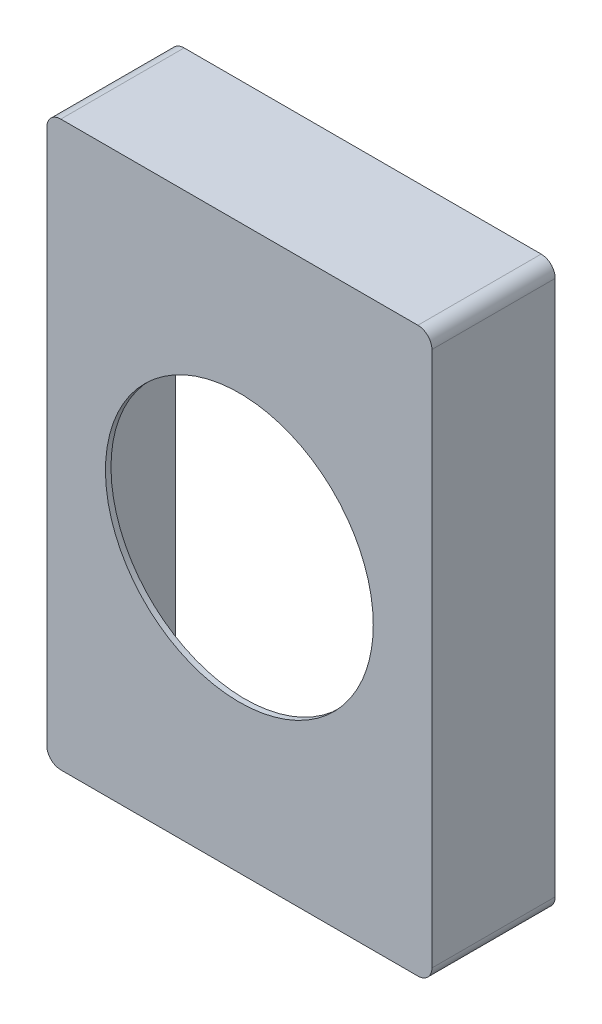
ISO-10303-21;
HEADER;
FILE_DESCRIPTION(('STEP AP214'),'2;1');
FILE_NAME('part.step','',(''),(''),'','','');
FILE_SCHEMA(('AUTOMOTIVE_DESIGN { 1 0 10303 214 1 1 1 1 }'));
ENDSEC;
DATA;
#1=APPLICATION_CONTEXT('core data for automotive mechanical design processes');
#2=APPLICATION_PROTOCOL_DEFINITION('international standard','automotive_design',2000,#1);
#3=PRODUCT_CONTEXT('',#1,'mechanical');
#4=PRODUCT('Part','Part','',(#3));
#5=PRODUCT_RELATED_PRODUCT_CATEGORY('part','',(#4));
#6=PRODUCT_DEFINITION_FORMATION('','',#4);
#7=PRODUCT_DEFINITION_CONTEXT('part definition',#1,'design');
#8=PRODUCT_DEFINITION('design','',#6,#7);
#9=PRODUCT_DEFINITION_SHAPE('','',#8);
#10=(LENGTH_UNIT() NAMED_UNIT(*) SI_UNIT(.MILLI.,.METRE.));
#11=(NAMED_UNIT(*) PLANE_ANGLE_UNIT() SI_UNIT($,.RADIAN.));
#12=(NAMED_UNIT(*) SI_UNIT($,.STERADIAN.) SOLID_ANGLE_UNIT());
#13=UNCERTAINTY_MEASURE_WITH_UNIT(LENGTH_MEASURE(1.E-05),#10,'distance_accuracy_value','');
#14=(GEOMETRIC_REPRESENTATION_CONTEXT(3) GLOBAL_UNCERTAINTY_ASSIGNED_CONTEXT((#13)) GLOBAL_UNIT_ASSIGNED_CONTEXT((#10,
#11,#12)) REPRESENTATION_CONTEXT('',''));
#15=CARTESIAN_POINT('',(0.,0.,0.));
#16=DIRECTION('',(0.,0.,1.));
#17=DIRECTION('',(1.,0.,0.));
#18=AXIS2_PLACEMENT_3D('',#15,#16,#17);
#19=CARTESIAN_POINT('',(32.,-8.49999999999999,-8.8));
#20=DIRECTION('',(0.,0.,1.));
#21=DIRECTION('',(1.,0.,0.));
#22=AXIS2_PLACEMENT_3D('',#19,#20,#21);
#23=CYLINDRICAL_SURFACE('',#22,5.);
#24=CARTESIAN_POINT('',(32.,-8.49999999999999,-8.8));
#25=DIRECTION('',(0.,0.,-1.));
#26=DIRECTION('',(-1.,0.,0.));
#27=AXIS2_PLACEMENT_3D('',#24,#25,#26);
#28=CIRCLE('',#27,5.);
#29=CARTESIAN_POINT('',(27.,-8.49999999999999,-8.8));
#30=VERTEX_POINT('',#29);
#31=EDGE_CURVE('E219',#30,#30,#28,.T.);
#32=ORIENTED_EDGE('',*,*,#31,.F.);
#33=EDGE_LOOP('',(#32));
#34=FACE_BOUND('',#33,.T.);
#35=DIRECTION('',(0.,0.,1.));
#36=VECTOR('',#35,1.);
#37=CARTESIAN_POINT('',(28.9350382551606,-12.4504442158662,-1.));
#38=LINE('',#37,#36);
#39=CARTESIAN_POINT('',(28.9350382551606,-12.4504442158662,-1.));
#40=VERTEX_POINT('',#39);
#41=CARTESIAN_POINT('',(28.9350382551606,-12.4504442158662,6.2));
#42=VERTEX_POINT('',#41);
#43=EDGE_CURVE('E175',#40,#42,#38,.T.);
#44=ORIENTED_EDGE('',*,*,#43,.F.);
#45=CARTESIAN_POINT('',(32.,-8.49999999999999,-1.));
#46=DIRECTION('',(0.,0.,1.));
#47=DIRECTION('',(1.,0.,0.));
#48=AXIS2_PLACEMENT_3D('',#45,#46,#47);
#49=CIRCLE('',#48,5.);
#50=CARTESIAN_POINT('',(31.2993973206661,-3.54932773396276,-1.));
#51=VERTEX_POINT('',#50);
#52=EDGE_CURVE('E179',#51,#40,#49,.T.);
#53=ORIENTED_EDGE('',*,*,#52,.F.);
#54=DIRECTION('',(0.,0.,1.));
#55=VECTOR('',#54,1.);
#56=CARTESIAN_POINT('',(31.2993973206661,-3.54932773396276,-1.));
#57=LINE('',#56,#55);
#58=CARTESIAN_POINT('',(31.2993973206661,-3.54932773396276,6.2));
#59=VERTEX_POINT('',#58);
#60=EDGE_CURVE('E177',#51,#59,#57,.T.);
#61=ORIENTED_EDGE('',*,*,#60,.T.);
#62=CARTESIAN_POINT('',(32.,-8.49999999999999,6.2));
#63=DIRECTION('',(0.,0.,-1.));
#64=DIRECTION('',(-1.,0.,0.));
#65=AXIS2_PLACEMENT_3D('',#62,#63,#64);
#66=CIRCLE('',#65,5.);
#67=EDGE_CURVE('E186',#59,#42,#66,.T.);
#68=ORIENTED_EDGE('',*,*,#67,.T.);
#69=EDGE_LOOP('',(#44,#53,#61,#68));
#70=FACE_BOUND('',#69,.T.);
#71=ADVANCED_FACE('F47',(#34,#70),#23,.T.);
#72=CARTESIAN_POINT('',(0.,0.,7.5));
#73=DIRECTION('',(0.,0.,1.));
#74=DIRECTION('',(1.,0.,0.));
#75=AXIS2_PLACEMENT_3D('',#72,#73,#74);
#76=PLANE('',#75);
#77=CARTESIAN_POINT('',(0.,0.,7.5));
#78=DIRECTION('',(0.,0.,1.));
#79=DIRECTION('',(1.,0.,0.));
#80=AXIS2_PLACEMENT_3D('',#77,#78,#79);
#81=CIRCLE('',#80,31.5);
#82=CARTESIAN_POINT('',(31.5,0.,7.5));
#83=VERTEX_POINT('',#82);
#84=EDGE_CURVE('E239',#83,#83,#81,.T.);
#85=ORIENTED_EDGE('',*,*,#84,.F.);
#86=EDGE_LOOP('',(#85));
#87=FACE_BOUND('',#86,.T.);
#88=DIRECTION('',(-1.,0.,0.));
#89=VECTOR('',#88,1.);
#90=CARTESIAN_POINT('',(-45.3,66.3,7.5));
#91=LINE('',#90,#89);
#92=CARTESIAN_POINT('',(42.,66.3,7.5));
#93=VERTEX_POINT('',#92);
#94=CARTESIAN_POINT('',(-42.,66.3,7.5));
#95=VERTEX_POINT('',#94);
#96=EDGE_CURVE('E254',#93,#95,#91,.T.);
#97=ORIENTED_EDGE('',*,*,#96,.T.);
#98=CARTESIAN_POINT('',(-42.,63.,7.5));
#99=DIRECTION('',(0.,0.,1.));
#100=DIRECTION('',(1.,0.,0.));
#101=AXIS2_PLACEMENT_3D('',#98,#99,#100);
#102=CIRCLE('',#101,3.3);
#103=CARTESIAN_POINT('',(-45.3,63.,7.5));
#104=VERTEX_POINT('',#103);
#105=EDGE_CURVE('E347',#95,#104,#102,.T.);
#106=ORIENTED_EDGE('',*,*,#105,.T.);
#107=DIRECTION('',(0.,-1.,0.));
#108=VECTOR('',#107,1.);
#109=CARTESIAN_POINT('',(-45.3,66.3,7.5));
#110=LINE('',#109,#108);
#111=CARTESIAN_POINT('',(-45.3,-63.,7.5));
#112=VERTEX_POINT('',#111);
#113=EDGE_CURVE('E270',#104,#112,#110,.T.);
#114=ORIENTED_EDGE('',*,*,#113,.T.);
#115=CARTESIAN_POINT('',(-42.,-63.,7.5));
#116=DIRECTION('',(0.,0.,1.));
#117=DIRECTION('',(1.,0.,0.));
#118=AXIS2_PLACEMENT_3D('',#115,#116,#117);
#119=CIRCLE('',#118,3.3);
#120=CARTESIAN_POINT('',(-42.,-66.3,7.5));
#121=VERTEX_POINT('',#120);
#122=EDGE_CURVE('E345',#112,#121,#119,.T.);
#123=ORIENTED_EDGE('',*,*,#122,.T.);
#124=DIRECTION('',(1.,0.,0.));
#125=VECTOR('',#124,1.);
#126=CARTESIAN_POINT('',(-45.3,-66.3,7.5));
#127=LINE('',#126,#125);
#128=CARTESIAN_POINT('',(42.,-66.3,7.5));
#129=VERTEX_POINT('',#128);
#130=EDGE_CURVE('E273',#121,#129,#127,.T.);
#131=ORIENTED_EDGE('',*,*,#130,.T.);
#132=CARTESIAN_POINT('',(42.,-63.,7.5));
#133=DIRECTION('',(0.,0.,1.));
#134=DIRECTION('',(1.,0.,0.));
#135=AXIS2_PLACEMENT_3D('',#132,#133,#134);
#136=CIRCLE('',#135,3.3);
#137=CARTESIAN_POINT('',(45.3,-63.,7.5));
#138=VERTEX_POINT('',#137);
#139=EDGE_CURVE('E343',#129,#138,#136,.T.);
#140=ORIENTED_EDGE('',*,*,#139,.T.);
#141=DIRECTION('',(0.,1.,0.));
#142=VECTOR('',#141,1.);
#143=CARTESIAN_POINT('',(45.3,66.3,7.5));
#144=LINE('',#143,#142);
#145=CARTESIAN_POINT('',(45.3,63.,7.5));
#146=VERTEX_POINT('',#145);
#147=EDGE_CURVE('E259',#138,#146,#144,.T.);
#148=ORIENTED_EDGE('',*,*,#147,.T.);
#149=CARTESIAN_POINT('',(42.,63.,7.5));
#150=DIRECTION('',(0.,0.,1.));
#151=DIRECTION('',(1.,0.,0.));
#152=AXIS2_PLACEMENT_3D('',#149,#150,#151);
#153=CIRCLE('',#152,3.3);
#154=EDGE_CURVE('E341',#146,#93,#153,.T.);
#155=ORIENTED_EDGE('',*,*,#154,.T.);
#156=EDGE_LOOP('',(#97,#106,#114,#123,#131,#140,#148,#155));
#157=FACE_BOUND('',#156,.T.);
#158=ADVANCED_FACE('F374',(#87,#157),#76,.T.);
#159=CARTESIAN_POINT('',(-44.,65.,-21.5));
#160=DIRECTION('',(-1.,0.,0.));
#161=DIRECTION('',(0.,0.,1.));
#162=AXIS2_PLACEMENT_3D('',#159,#160,#161);
#163=PLANE('',#162);
#164=DIRECTION('',(0.,-1.,0.));
#165=VECTOR('',#164,1.);
#166=CARTESIAN_POINT('',(-44.,65.,-21.5));
#167=LINE('',#166,#165);
#168=CARTESIAN_POINT('',(-44.,63.,-21.5));
#169=VERTEX_POINT('',#168);
#170=CARTESIAN_POINT('',(-44.,-63.,-21.5));
#171=VERTEX_POINT('',#170);
#172=EDGE_CURVE('E242',#169,#171,#167,.T.);
#173=ORIENTED_EDGE('',*,*,#172,.F.);
#174=DIRECTION('',(0.,0.,1.));
#175=VECTOR('',#174,1.);
#176=CARTESIAN_POINT('',(-44.,63.,6.2));
#177=LINE('',#176,#175);
#178=CARTESIAN_POINT('',(-44.,63.,6.2));
#179=VERTEX_POINT('',#178);
#180=EDGE_CURVE('E302',#169,#179,#177,.T.);
#181=ORIENTED_EDGE('',*,*,#180,.T.);
#182=DIRECTION('',(0.,-1.,0.));
#183=VECTOR('',#182,1.);
#184=CARTESIAN_POINT('',(-44.,0.,6.2));
#185=LINE('',#184,#183);
#186=CARTESIAN_POINT('',(-44.,-63.,6.2));
#187=VERTEX_POINT('',#186);
#188=EDGE_CURVE('E283',#179,#187,#185,.T.);
#189=ORIENTED_EDGE('',*,*,#188,.T.);
#190=DIRECTION('',(0.,0.,1.));
#191=VECTOR('',#190,1.);
#192=CARTESIAN_POINT('',(-44.,-63.,-21.5));
#193=LINE('',#192,#191);
#194=EDGE_CURVE('E196',#187,#171,#193,.F.);
#195=ORIENTED_EDGE('',*,*,#194,.T.);
#196=EDGE_LOOP('',(#173,#181,#189,#195));
#197=FACE_BOUND('',#196,.T.);
#198=ADVANCED_FACE('F413',(#197),#163,.F.);
#199=CARTESIAN_POINT('',(-44.,65.,-21.5));
#200=DIRECTION('',(0.,1.,0.));
#201=DIRECTION('',(0.,0.,1.));
#202=AXIS2_PLACEMENT_3D('',#199,#200,#201);
#203=PLANE('',#202);
#204=DIRECTION('',(1.,0.,0.));
#205=VECTOR('',#204,1.);
#206=CARTESIAN_POINT('',(0.,65.,6.2));
#207=LINE('',#206,#205);
#208=CARTESIAN_POINT('',(-42.,65.,6.2));
#209=VERTEX_POINT('',#208);
#210=CARTESIAN_POINT('',(42.,65.,6.2));
#211=VERTEX_POINT('',#210);
#212=EDGE_CURVE('E280',#209,#211,#207,.T.);
#213=ORIENTED_EDGE('',*,*,#212,.F.);
#214=DIRECTION('',(0.,0.,1.));
#215=VECTOR('',#214,1.);
#216=CARTESIAN_POINT('',(-42.,65.,-21.5));
#217=LINE('',#216,#215);
#218=CARTESIAN_POINT('',(-42.,65.,-21.5));
#219=VERTEX_POINT('',#218);
#220=EDGE_CURVE('E316',#209,#219,#217,.F.);
#221=ORIENTED_EDGE('',*,*,#220,.T.);
#222=DIRECTION('',(-1.,0.,0.));
#223=VECTOR('',#222,1.);
#224=CARTESIAN_POINT('',(-44.,65.,-21.5));
#225=LINE('',#224,#223);
#226=CARTESIAN_POINT('',(42.,65.,-21.5));
#227=VERTEX_POINT('',#226);
#228=EDGE_CURVE('E251',#227,#219,#225,.T.);
#229=ORIENTED_EDGE('',*,*,#228,.F.);
#230=DIRECTION('',(0.,0.,1.));
#231=VECTOR('',#230,1.);
#232=CARTESIAN_POINT('',(42.,65.,6.2));
#233=LINE('',#232,#231);
#234=EDGE_CURVE('E313',#227,#211,#233,.T.);
#235=ORIENTED_EDGE('',*,*,#234,.T.);
#236=EDGE_LOOP('',(#213,#221,#229,#235));
#237=FACE_BOUND('',#236,.T.);
#238=ADVANCED_FACE('F460',(#237),#203,.F.);
#239=CARTESIAN_POINT('',(44.,65.,-21.5));
#240=DIRECTION('',(1.,0.,0.));
#241=DIRECTION('',(0.,0.,-1.));
#242=AXIS2_PLACEMENT_3D('',#239,#240,#241);
#243=PLANE('',#242);
#244=DIRECTION('',(0.,1.,0.));
#245=VECTOR('',#244,1.);
#246=CARTESIAN_POINT('',(44.,65.,-21.5));
#247=LINE('',#246,#245);
#248=CARTESIAN_POINT('',(44.,-63.,-21.5));
#249=VERTEX_POINT('',#248);
#250=CARTESIAN_POINT('',(44.,63.,-21.5));
#251=VERTEX_POINT('',#250);
#252=EDGE_CURVE('E248',#249,#251,#247,.T.);
#253=ORIENTED_EDGE('',*,*,#252,.F.);
#254=DIRECTION('',(0.,0.,1.));
#255=VECTOR('',#254,1.);
#256=CARTESIAN_POINT('',(44.,-63.,6.19999999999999));
#257=LINE('',#256,#255);
#258=CARTESIAN_POINT('',(44.,-63.,6.2));
#259=VERTEX_POINT('',#258);
#260=EDGE_CURVE('E325',#249,#259,#257,.T.);
#261=ORIENTED_EDGE('',*,*,#260,.T.);
#262=DIRECTION('',(0.,-1.,0.));
#263=VECTOR('',#262,1.);
#264=CARTESIAN_POINT('',(44.,0.,6.2));
#265=LINE('',#264,#263);
#266=CARTESIAN_POINT('',(44.,63.,6.2));
#267=VERTEX_POINT('',#266);
#268=EDGE_CURVE('E267',#267,#259,#265,.T.);
#269=ORIENTED_EDGE('',*,*,#268,.F.);
#270=DIRECTION('',(0.,0.,1.));
#271=VECTOR('',#270,1.);
#272=CARTESIAN_POINT('',(44.,63.,-21.5));
#273=LINE('',#272,#271);
#274=EDGE_CURVE('E323',#267,#251,#273,.F.);
#275=ORIENTED_EDGE('',*,*,#274,.T.);
#276=EDGE_LOOP('',(#253,#261,#269,#275));
#277=FACE_BOUND('',#276,.T.);
#278=ADVANCED_FACE('F463',(#277),#243,.F.);
#279=CARTESIAN_POINT('',(-44.,-65.,-21.5));
#280=DIRECTION('',(0.,-1.,0.));
#281=DIRECTION('',(0.,0.,-1.));
#282=AXIS2_PLACEMENT_3D('',#279,#280,#281);
#283=PLANE('',#282);
#284=DIRECTION('',(1.,0.,0.));
#285=VECTOR('',#284,1.);
#286=CARTESIAN_POINT('',(-44.,-65.,-21.5));
#287=LINE('',#286,#285);
#288=CARTESIAN_POINT('',(-42.,-65.,-21.5));
#289=VERTEX_POINT('',#288);
#290=CARTESIAN_POINT('',(42.,-65.,-21.5));
#291=VERTEX_POINT('',#290);
#292=EDGE_CURVE('E245',#289,#291,#287,.T.);
#293=ORIENTED_EDGE('',*,*,#292,.F.);
#294=DIRECTION('',(0.,0.,1.));
#295=VECTOR('',#294,1.);
#296=CARTESIAN_POINT('',(-42.,-65.,6.2));
#297=LINE('',#296,#295);
#298=CARTESIAN_POINT('',(-42.,-65.,6.2));
#299=VERTEX_POINT('',#298);
#300=EDGE_CURVE('E320',#289,#299,#297,.T.);
#301=ORIENTED_EDGE('',*,*,#300,.T.);
#302=DIRECTION('',(1.,0.,0.));
#303=VECTOR('',#302,1.);
#304=CARTESIAN_POINT('',(0.,-65.,6.2));
#305=LINE('',#304,#303);
#306=CARTESIAN_POINT('',(42.,-65.,6.2));
#307=VERTEX_POINT('',#306);
#308=EDGE_CURVE('E286',#299,#307,#305,.T.);
#309=ORIENTED_EDGE('',*,*,#308,.T.);
#310=DIRECTION('',(0.,0.,1.));
#311=VECTOR('',#310,1.);
#312=CARTESIAN_POINT('',(42.,-65.,-21.5));
#313=LINE('',#312,#311);
#314=EDGE_CURVE('E318',#307,#291,#313,.F.);
#315=ORIENTED_EDGE('',*,*,#314,.T.);
#316=EDGE_LOOP('',(#293,#301,#309,#315));
#317=FACE_BOUND('',#316,.T.);
#318=ADVANCED_FACE('F467',(#317),#283,.F.);
#319=CARTESIAN_POINT('',(-45.3,66.3,-21.5));
#320=DIRECTION('',(0.,1.,0.));
#321=DIRECTION('',(0.,0.,1.));
#322=AXIS2_PLACEMENT_3D('',#319,#320,#321);
#323=PLANE('',#322);
#324=DIRECTION('',(-1.,0.,0.));
#325=VECTOR('',#324,1.);
#326=CARTESIAN_POINT('',(-45.3,66.3,-21.5));
#327=LINE('',#326,#325);
#328=CARTESIAN_POINT('',(42.,66.3,-21.5));
#329=VERTEX_POINT('',#328);
#330=CARTESIAN_POINT('',(-42.,66.3,-21.5));
#331=VERTEX_POINT('',#330);
#332=EDGE_CURVE('E255',#329,#331,#327,.T.);
#333=ORIENTED_EDGE('',*,*,#332,.T.);
#334=DIRECTION('',(0.,0.,1.));
#335=VECTOR('',#334,1.);
#336=CARTESIAN_POINT('',(-42.,66.3,-21.5));
#337=LINE('',#336,#335);
#338=EDGE_CURVE('E338',#331,#95,#337,.T.);
#339=ORIENTED_EDGE('',*,*,#338,.T.);
#340=ORIENTED_EDGE('',*,*,#96,.F.);
#341=DIRECTION('',(0.,0.,1.));
#342=VECTOR('',#341,1.);
#343=CARTESIAN_POINT('',(42.,66.3,-21.5));
#344=LINE('',#343,#342);
#345=EDGE_CURVE('E336',#93,#329,#344,.F.);
#346=ORIENTED_EDGE('',*,*,#345,.T.);
#347=EDGE_LOOP('',(#333,#339,#340,#346));
#348=FACE_BOUND('',#347,.T.);
#349=ADVANCED_FACE('F398',(#348),#323,.T.);
#350=CARTESIAN_POINT('',(45.3,66.3,-21.5));
#351=DIRECTION('',(1.,0.,0.));
#352=DIRECTION('',(0.,1.,0.));
#353=AXIS2_PLACEMENT_3D('',#350,#351,#352);
#354=PLANE('',#353);
#355=ORIENTED_EDGE('',*,*,#147,.F.);
#356=DIRECTION('',(0.,0.,1.));
#357=VECTOR('',#356,1.);
#358=CARTESIAN_POINT('',(45.3,-63.,-21.5));
#359=LINE('',#358,#357);
#360=CARTESIAN_POINT('',(45.3,-63.,-21.5));
#361=VERTEX_POINT('',#360);
#362=EDGE_CURVE('E11',#138,#361,#359,.F.);
#363=ORIENTED_EDGE('',*,*,#362,.T.);
#364=DIRECTION('',(0.,1.,0.));
#365=VECTOR('',#364,1.);
#366=CARTESIAN_POINT('',(45.3,66.3,-21.5));
#367=LINE('',#366,#365);
#368=CARTESIAN_POINT('',(45.3,63.,-21.5));
#369=VERTEX_POINT('',#368);
#370=EDGE_CURVE('E264',#361,#369,#367,.T.);
#371=ORIENTED_EDGE('',*,*,#370,.T.);
#372=DIRECTION('',(0.,0.,1.));
#373=VECTOR('',#372,1.);
#374=CARTESIAN_POINT('',(45.3,63.,-21.5));
#375=LINE('',#374,#373);
#376=EDGE_CURVE('E55',#369,#146,#375,.T.);
#377=ORIENTED_EDGE('',*,*,#376,.T.);
#378=EDGE_LOOP('',(#355,#363,#371,#377));
#379=FACE_BOUND('',#378,.T.);
#380=ADVANCED_FACE('F369',(#379),#354,.T.);
#381=CARTESIAN_POINT('',(-45.3,-66.3,-21.5));
#382=DIRECTION('',(0.,-1.,0.));
#383=DIRECTION('',(0.,0.,-1.));
#384=AXIS2_PLACEMENT_3D('',#381,#382,#383);
#385=PLANE('',#384);
#386=ORIENTED_EDGE('',*,*,#130,.F.);
#387=DIRECTION('',(0.,0.,1.));
#388=VECTOR('',#387,1.);
#389=CARTESIAN_POINT('',(-42.,-66.3,-21.5));
#390=LINE('',#389,#388);
#391=CARTESIAN_POINT('',(-42.,-66.3,-21.5));
#392=VERTEX_POINT('',#391);
#393=EDGE_CURVE('E364',#121,#392,#390,.F.);
#394=ORIENTED_EDGE('',*,*,#393,.T.);
#395=DIRECTION('',(1.,0.,0.));
#396=VECTOR('',#395,1.);
#397=CARTESIAN_POINT('',(-45.3,-66.3,-21.5));
#398=LINE('',#397,#396);
#399=CARTESIAN_POINT('',(42.,-66.3,-21.5));
#400=VERTEX_POINT('',#399);
#401=EDGE_CURVE('E262',#392,#400,#398,.T.);
#402=ORIENTED_EDGE('',*,*,#401,.T.);
#403=DIRECTION('',(0.,0.,1.));
#404=VECTOR('',#403,1.);
#405=CARTESIAN_POINT('',(42.,-66.3,-21.5));
#406=LINE('',#405,#404);
#407=EDGE_CURVE('E361',#400,#129,#406,.T.);
#408=ORIENTED_EDGE('',*,*,#407,.T.);
#409=EDGE_LOOP('',(#386,#394,#402,#408));
#410=FACE_BOUND('',#409,.T.);
#411=ADVANCED_FACE('F381',(#410),#385,.T.);
#412=CARTESIAN_POINT('',(-45.3,66.3,-21.5));
#413=DIRECTION('',(-1.,0.,0.));
#414=DIRECTION('',(0.,0.,1.));
#415=AXIS2_PLACEMENT_3D('',#412,#413,#414);
#416=PLANE('',#415);
#417=ORIENTED_EDGE('',*,*,#113,.F.);
#418=DIRECTION('',(0.,0.,1.));
#419=VECTOR('',#418,1.);
#420=CARTESIAN_POINT('',(-45.3,63.,-21.5));
#421=LINE('',#420,#419);
#422=CARTESIAN_POINT('',(-45.3,63.,-21.5));
#423=VERTEX_POINT('',#422);
#424=EDGE_CURVE('E352',#104,#423,#421,.F.);
#425=ORIENTED_EDGE('',*,*,#424,.T.);
#426=DIRECTION('',(0.,-1.,0.));
#427=VECTOR('',#426,1.);
#428=CARTESIAN_POINT('',(-45.3,66.3,-21.5));
#429=LINE('',#428,#427);
#430=CARTESIAN_POINT('',(-45.3,-63.,-21.5));
#431=VERTEX_POINT('',#430);
#432=EDGE_CURVE('E258',#423,#431,#429,.T.);
#433=ORIENTED_EDGE('',*,*,#432,.T.);
#434=DIRECTION('',(0.,0.,1.));
#435=VECTOR('',#434,1.);
#436=CARTESIAN_POINT('',(-45.3,-63.,-21.5));
#437=LINE('',#436,#435);
#438=EDGE_CURVE('E349',#431,#112,#437,.T.);
#439=ORIENTED_EDGE('',*,*,#438,.T.);
#440=EDGE_LOOP('',(#417,#425,#433,#439));
#441=FACE_BOUND('',#440,.T.);
#442=ADVANCED_FACE('F391',(#441),#416,.T.);
#443=CARTESIAN_POINT('',(0.,0.,-21.5));
#444=DIRECTION('',(0.,0.,-1.));
#445=DIRECTION('',(-1.,0.,0.));
#446=AXIS2_PLACEMENT_3D('',#443,#444,#445);
#447=PLANE('',#446);
#448=ORIENTED_EDGE('',*,*,#228,.T.);
#449=CARTESIAN_POINT('',(-42.,63.,-21.5));
#450=DIRECTION('',(0.,0.,-1.));
#451=DIRECTION('',(-1.,0.,0.));
#452=AXIS2_PLACEMENT_3D('',#449,#450,#451);
#453=CIRCLE('',#452,2.);
#454=EDGE_CURVE('E328',#219,#169,#453,.F.);
#455=ORIENTED_EDGE('',*,*,#454,.T.);
#456=ORIENTED_EDGE('',*,*,#172,.T.);
#457=CARTESIAN_POINT('',(-42.,-63.,-21.5));
#458=DIRECTION('',(0.,0.,-1.));
#459=DIRECTION('',(-1.,0.,0.));
#460=AXIS2_PLACEMENT_3D('',#457,#458,#459);
#461=CIRCLE('',#460,2.);
#462=EDGE_CURVE('E330',#171,#289,#461,.F.);
#463=ORIENTED_EDGE('',*,*,#462,.T.);
#464=ORIENTED_EDGE('',*,*,#292,.T.);
#465=CARTESIAN_POINT('',(42.,-63.,-21.5));
#466=DIRECTION('',(0.,0.,-1.));
#467=DIRECTION('',(-1.,0.,0.));
#468=AXIS2_PLACEMENT_3D('',#465,#466,#467);
#469=CIRCLE('',#468,2.);
#470=EDGE_CURVE('E332',#291,#249,#469,.F.);
#471=ORIENTED_EDGE('',*,*,#470,.T.);
#472=ORIENTED_EDGE('',*,*,#252,.T.);
#473=CARTESIAN_POINT('',(42.,63.,-21.5));
#474=DIRECTION('',(0.,0.,-1.));
#475=DIRECTION('',(-1.,0.,0.));
#476=AXIS2_PLACEMENT_3D('',#473,#474,#475);
#477=CIRCLE('',#476,2.);
#478=EDGE_CURVE('E334',#251,#227,#477,.F.);
#479=ORIENTED_EDGE('',*,*,#478,.T.);
#480=EDGE_LOOP('',(#448,#455,#456,#463,#464,#471,#472,#479));
#481=FACE_BOUND('',#480,.T.);
#482=ORIENTED_EDGE('',*,*,#432,.F.);
#483=CARTESIAN_POINT('',(-42.,63.,-21.5));
#484=DIRECTION('',(0.,0.,-1.));
#485=DIRECTION('',(-1.,0.,0.));
#486=AXIS2_PLACEMENT_3D('',#483,#484,#485);
#487=CIRCLE('',#486,3.3);
#488=EDGE_CURVE('E359',#423,#331,#487,.T.);
#489=ORIENTED_EDGE('',*,*,#488,.T.);
#490=ORIENTED_EDGE('',*,*,#332,.F.);
#491=CARTESIAN_POINT('',(42.,63.,-21.5));
#492=DIRECTION('',(0.,0.,-1.));
#493=DIRECTION('',(-1.,0.,0.));
#494=AXIS2_PLACEMENT_3D('',#491,#492,#493);
#495=CIRCLE('',#494,3.3);
#496=EDGE_CURVE('E354',#329,#369,#495,.T.);
#497=ORIENTED_EDGE('',*,*,#496,.T.);
#498=ORIENTED_EDGE('',*,*,#370,.F.);
#499=CARTESIAN_POINT('',(42.,-63.,-21.5));
#500=DIRECTION('',(0.,0.,-1.));
#501=DIRECTION('',(-1.,0.,0.));
#502=AXIS2_PLACEMENT_3D('',#499,#500,#501);
#503=CIRCLE('',#502,3.3);
#504=EDGE_CURVE('E69',#361,#400,#503,.T.);
#505=ORIENTED_EDGE('',*,*,#504,.T.);
#506=ORIENTED_EDGE('',*,*,#401,.F.);
#507=CARTESIAN_POINT('',(-42.,-63.,-21.5));
#508=DIRECTION('',(0.,0.,-1.));
#509=DIRECTION('',(-1.,0.,0.));
#510=AXIS2_PLACEMENT_3D('',#507,#508,#509);
#511=CIRCLE('',#510,3.3);
#512=EDGE_CURVE('E357',#392,#431,#511,.T.);
#513=ORIENTED_EDGE('',*,*,#512,.T.);
#514=EDGE_LOOP('',(#482,#489,#490,#497,#498,#505,#506,#513));
#515=FACE_BOUND('',#514,.T.);
#516=ADVANCED_FACE('F385',(#481,#515),#447,.T.);
#517=CARTESIAN_POINT('',(0.,0.,6.2));
#518=DIRECTION('',(0.,0.,1.));
#519=DIRECTION('',(1.,0.,0.));
#520=AXIS2_PLACEMENT_3D('',#517,#518,#519);
#521=PLANE('',#520);
#522=ORIENTED_EDGE('',*,*,#67,.F.);
#523=CARTESIAN_POINT('',(0.,0.,6.2));
#524=DIRECTION('',(0.,0.,1.));
#525=DIRECTION('',(1.,0.,0.));
#526=AXIS2_PLACEMENT_3D('',#523,#524,#525);
#527=CIRCLE('',#526,31.5);
#528=EDGE_CURVE('E238',#59,#42,#527,.T.);
#529=ORIENTED_EDGE('',*,*,#528,.T.);
#530=EDGE_LOOP('',(#522,#529));
#531=FACE_BOUND('',#530,.T.);
#532=CARTESIAN_POINT('',(31.,52.,6.2));
#533=DIRECTION('',(0.,0.,1.));
#534=DIRECTION('',(1.,0.,0.));
#535=AXIS2_PLACEMENT_3D('',#532,#533,#534);
#536=CIRCLE('',#535,5.);
#537=CARTESIAN_POINT('',(36.,52.,6.2));
#538=VERTEX_POINT('',#537);
#539=EDGE_CURVE('E222',#538,#538,#536,.F.);
#540=ORIENTED_EDGE('',*,*,#539,.F.);
#541=EDGE_LOOP('',(#540));
#542=FACE_BOUND('',#541,.T.);
#543=CARTESIAN_POINT('',(-33.5,55.,6.2));
#544=DIRECTION('',(0.,0.,1.));
#545=DIRECTION('',(1.,0.,0.));
#546=AXIS2_PLACEMENT_3D('',#543,#544,#545);
#547=CIRCLE('',#546,5.);
#548=CARTESIAN_POINT('',(-28.5,55.,6.2));
#549=VERTEX_POINT('',#548);
#550=EDGE_CURVE('E296',#549,#549,#547,.F.);
#551=ORIENTED_EDGE('',*,*,#550,.F.);
#552=EDGE_LOOP('',(#551));
#553=FACE_BOUND('',#552,.T.);
#554=CARTESIAN_POINT('',(-33.,-51.,6.2));
#555=DIRECTION('',(0.,0.,1.));
#556=DIRECTION('',(1.,0.,0.));
#557=AXIS2_PLACEMENT_3D('',#554,#555,#556);
#558=CIRCLE('',#557,5.);
#559=CARTESIAN_POINT('',(-28.,-51.,6.2));
#560=VERTEX_POINT('',#559);
#561=EDGE_CURVE('E293',#560,#560,#558,.F.);
#562=ORIENTED_EDGE('',*,*,#561,.F.);
#563=EDGE_LOOP('',(#562));
#564=FACE_BOUND('',#563,.T.);
#565=CARTESIAN_POINT('',(33.,-54.5,6.2));
#566=DIRECTION('',(0.,0.,1.));
#567=DIRECTION('',(1.,0.,0.));
#568=AXIS2_PLACEMENT_3D('',#565,#566,#567);
#569=CIRCLE('',#568,5.);
#570=CARTESIAN_POINT('',(38.,-54.5,6.2));
#571=VERTEX_POINT('',#570);
#572=EDGE_CURVE('E289',#571,#571,#569,.F.);
#573=ORIENTED_EDGE('',*,*,#572,.F.);
#574=EDGE_LOOP('',(#573));
#575=FACE_BOUND('',#574,.T.);
#576=ORIENTED_EDGE('',*,*,#188,.F.);
#577=CARTESIAN_POINT('',(-42.,63.,6.2));
#578=DIRECTION('',(0.,0.,1.));
#579=DIRECTION('',(1.,0.,0.));
#580=AXIS2_PLACEMENT_3D('',#577,#578,#579);
#581=CIRCLE('',#580,2.);
#582=EDGE_CURVE('E311',#179,#209,#581,.F.);
#583=ORIENTED_EDGE('',*,*,#582,.T.);
#584=ORIENTED_EDGE('',*,*,#212,.T.);
#585=CARTESIAN_POINT('',(42.,63.,6.2));
#586=DIRECTION('',(0.,0.,1.));
#587=DIRECTION('',(1.,0.,0.));
#588=AXIS2_PLACEMENT_3D('',#585,#586,#587);
#589=CIRCLE('',#588,2.);
#590=EDGE_CURVE('E305',#211,#267,#589,.F.);
#591=ORIENTED_EDGE('',*,*,#590,.T.);
#592=ORIENTED_EDGE('',*,*,#268,.T.);
#593=CARTESIAN_POINT('',(42.,-63.,6.2));
#594=DIRECTION('',(0.,0.,1.));
#595=DIRECTION('',(1.,0.,0.));
#596=AXIS2_PLACEMENT_3D('',#593,#594,#595);
#597=CIRCLE('',#596,2.);
#598=EDGE_CURVE('E307',#259,#307,#597,.F.);
#599=ORIENTED_EDGE('',*,*,#598,.T.);
#600=ORIENTED_EDGE('',*,*,#308,.F.);
#601=CARTESIAN_POINT('',(-42.,-63.,6.2));
#602=DIRECTION('',(0.,0.,1.));
#603=DIRECTION('',(1.,0.,0.));
#604=AXIS2_PLACEMENT_3D('',#601,#602,#603);
#605=CIRCLE('',#604,2.);
#606=EDGE_CURVE('E309',#299,#187,#605,.F.);
#607=ORIENTED_EDGE('',*,*,#606,.T.);
#608=EDGE_LOOP('',(#576,#583,#584,#591,#592,#599,#600,#607));
#609=FACE_BOUND('',#608,.T.);
#610=ADVANCED_FACE('F459',(#531,#542,#553,#564,#575,#609),#521,.F.);
#611=CARTESIAN_POINT('',(0.,0.,8.5));
#612=DIRECTION('',(0.,0.,-1.));
#613=DIRECTION('',(-1.,0.,0.));
#614=AXIS2_PLACEMENT_3D('',#611,#612,#613);
#615=CYLINDRICAL_SURFACE('',#614,31.5);
#616=ORIENTED_EDGE('',*,*,#43,.T.);
#617=ORIENTED_EDGE('',*,*,#528,.F.);
#618=ORIENTED_EDGE('',*,*,#60,.F.);
#619=CARTESIAN_POINT('',(0.,0.,-1.));
#620=DIRECTION('',(0.,0.,1.));
#621=DIRECTION('',(1.,0.,0.));
#622=AXIS2_PLACEMENT_3D('',#619,#620,#621);
#623=CIRCLE('',#622,31.5);
#624=EDGE_CURVE('E61',#51,#40,#623,.F.);
#625=ORIENTED_EDGE('',*,*,#624,.T.);
#626=EDGE_LOOP('',(#616,#617,#618,#625));
#627=FACE_BOUND('',#626,.T.);
#628=ORIENTED_EDGE('',*,*,#84,.T.);
#629=EDGE_LOOP('',(#628));
#630=FACE_BOUND('',#629,.T.);
#631=ADVANCED_FACE('F171',(#627,#630),#615,.F.);
#632=CARTESIAN_POINT('',(33.,-54.5,-8.8));
#633=DIRECTION('',(0.,0.,1.));
#634=DIRECTION('',(1.,0.,0.));
#635=AXIS2_PLACEMENT_3D('',#632,#633,#634);
#636=CYLINDRICAL_SURFACE('',#635,5.);
#637=CARTESIAN_POINT('',(33.,-54.5,-8.8));
#638=DIRECTION('',(0.,0.,-1.));
#639=DIRECTION('',(-1.,0.,0.));
#640=AXIS2_PLACEMENT_3D('',#637,#638,#639);
#641=CIRCLE('',#640,5.);
#642=CARTESIAN_POINT('',(28.,-54.5,-8.8));
#643=VERTEX_POINT('',#642);
#644=EDGE_CURVE('E235',#643,#643,#641,.T.);
#645=ORIENTED_EDGE('',*,*,#644,.F.);
#646=EDGE_LOOP('',(#645));
#647=FACE_BOUND('',#646,.T.);
#648=ORIENTED_EDGE('',*,*,#572,.T.);
#649=EDGE_LOOP('',(#648));
#650=FACE_BOUND('',#649,.T.);
#651=ADVANCED_FACE('F452',(#647,#650),#636,.T.);
#652=CARTESIAN_POINT('',(33.,-54.5,-8.8));
#653=DIRECTION('',(0.,0.,-1.));
#654=DIRECTION('',(-1.,0.,0.));
#655=AXIS2_PLACEMENT_3D('',#652,#653,#654);
#656=PLANE('',#655);
#657=CARTESIAN_POINT('',(33.,-54.5,-8.8));
#658=DIRECTION('',(0.,0.,-1.));
#659=DIRECTION('',(-1.,0.,0.));
#660=AXIS2_PLACEMENT_3D('',#657,#658,#659);
#661=CIRCLE('',#660,2.5);
#662=CARTESIAN_POINT('',(30.5,-54.5,-8.8));
#663=VERTEX_POINT('',#662);
#664=EDGE_CURVE('E213',#663,#663,#661,.T.);
#665=ORIENTED_EDGE('',*,*,#664,.F.);
#666=EDGE_LOOP('',(#665));
#667=FACE_BOUND('',#666,.T.);
#668=ORIENTED_EDGE('',*,*,#644,.T.);
#669=EDGE_LOOP('',(#668));
#670=FACE_BOUND('',#669,.T.);
#671=ADVANCED_FACE('F445',(#667,#670),#656,.T.);
#672=CARTESIAN_POINT('',(-33.,-51.,-8.8));
#673=DIRECTION('',(0.,0.,1.));
#674=DIRECTION('',(1.,0.,0.));
#675=AXIS2_PLACEMENT_3D('',#672,#673,#674);
#676=CYLINDRICAL_SURFACE('',#675,5.);
#677=CARTESIAN_POINT('',(-33.,-51.,-8.8));
#678=DIRECTION('',(0.,0.,-1.));
#679=DIRECTION('',(-1.,0.,0.));
#680=AXIS2_PLACEMENT_3D('',#677,#678,#679);
#681=CIRCLE('',#680,5.);
#682=CARTESIAN_POINT('',(-38.,-51.,-8.8));
#683=VERTEX_POINT('',#682);
#684=EDGE_CURVE('E232',#683,#683,#681,.T.);
#685=ORIENTED_EDGE('',*,*,#684,.F.);
#686=EDGE_LOOP('',(#685));
#687=FACE_BOUND('',#686,.T.);
#688=ORIENTED_EDGE('',*,*,#561,.T.);
#689=EDGE_LOOP('',(#688));
#690=FACE_BOUND('',#689,.T.);
#691=ADVANCED_FACE('F442',(#687,#690),#676,.T.);
#692=CARTESIAN_POINT('',(-33.,-51.,-8.8));
#693=DIRECTION('',(0.,0.,-1.));
#694=DIRECTION('',(-1.,0.,0.));
#695=AXIS2_PLACEMENT_3D('',#692,#693,#694);
#696=PLANE('',#695);
#697=CARTESIAN_POINT('',(-33.,-51.,-8.8));
#698=DIRECTION('',(0.,0.,-1.));
#699=DIRECTION('',(-1.,0.,0.));
#700=AXIS2_PLACEMENT_3D('',#697,#698,#699);
#701=CIRCLE('',#700,2.5);
#702=CARTESIAN_POINT('',(-35.5,-51.,-8.8));
#703=VERTEX_POINT('',#702);
#704=EDGE_CURVE('E207',#703,#703,#701,.T.);
#705=ORIENTED_EDGE('',*,*,#704,.F.);
#706=EDGE_LOOP('',(#705));
#707=FACE_BOUND('',#706,.T.);
#708=ORIENTED_EDGE('',*,*,#684,.T.);
#709=EDGE_LOOP('',(#708));
#710=FACE_BOUND('',#709,.T.);
#711=ADVANCED_FACE('F437',(#707,#710),#696,.T.);
#712=CARTESIAN_POINT('',(-33.5,55.,-8.8));
#713=DIRECTION('',(0.,0.,1.));
#714=DIRECTION('',(1.,0.,0.));
#715=AXIS2_PLACEMENT_3D('',#712,#713,#714);
#716=CYLINDRICAL_SURFACE('',#715,5.);
#717=CARTESIAN_POINT('',(-33.5,55.,-8.8));
#718=DIRECTION('',(0.,0.,-1.));
#719=DIRECTION('',(-1.,0.,0.));
#720=AXIS2_PLACEMENT_3D('',#717,#718,#719);
#721=CIRCLE('',#720,5.);
#722=CARTESIAN_POINT('',(-38.5,55.,-8.8));
#723=VERTEX_POINT('',#722);
#724=EDGE_CURVE('E229',#723,#723,#721,.T.);
#725=ORIENTED_EDGE('',*,*,#724,.F.);
#726=EDGE_LOOP('',(#725));
#727=FACE_BOUND('',#726,.T.);
#728=ORIENTED_EDGE('',*,*,#550,.T.);
#729=EDGE_LOOP('',(#728));
#730=FACE_BOUND('',#729,.T.);
#731=ADVANCED_FACE('F434',(#727,#730),#716,.T.);
#732=CARTESIAN_POINT('',(-33.5,55.,-8.8));
#733=DIRECTION('',(0.,0.,-1.));
#734=DIRECTION('',(-1.,0.,0.));
#735=AXIS2_PLACEMENT_3D('',#732,#733,#734);
#736=PLANE('',#735);
#737=CARTESIAN_POINT('',(-33.5,55.,-8.8));
#738=DIRECTION('',(0.,0.,-1.));
#739=DIRECTION('',(-1.,0.,0.));
#740=AXIS2_PLACEMENT_3D('',#737,#738,#739);
#741=CIRCLE('',#740,2.5);
#742=CARTESIAN_POINT('',(-36.,55.,-8.8));
#743=VERTEX_POINT('',#742);
#744=EDGE_CURVE('E194',#743,#743,#741,.T.);
#745=ORIENTED_EDGE('',*,*,#744,.F.);
#746=EDGE_LOOP('',(#745));
#747=FACE_BOUND('',#746,.T.);
#748=ORIENTED_EDGE('',*,*,#724,.T.);
#749=EDGE_LOOP('',(#748));
#750=FACE_BOUND('',#749,.T.);
#751=ADVANCED_FACE('F429',(#747,#750),#736,.T.);
#752=CARTESIAN_POINT('',(31.,52.,-8.8));
#753=DIRECTION('',(0.,0.,1.));
#754=DIRECTION('',(1.,0.,0.));
#755=AXIS2_PLACEMENT_3D('',#752,#753,#754);
#756=CYLINDRICAL_SURFACE('',#755,5.);
#757=CARTESIAN_POINT('',(31.,52.,-8.8));
#758=DIRECTION('',(0.,0.,-1.));
#759=DIRECTION('',(-1.,0.,0.));
#760=AXIS2_PLACEMENT_3D('',#757,#758,#759);
#761=CIRCLE('',#760,5.);
#762=CARTESIAN_POINT('',(26.,52.,-8.8));
#763=VERTEX_POINT('',#762);
#764=EDGE_CURVE('E224',#763,#763,#761,.T.);
#765=ORIENTED_EDGE('',*,*,#764,.F.);
#766=EDGE_LOOP('',(#765));
#767=FACE_BOUND('',#766,.T.);
#768=ORIENTED_EDGE('',*,*,#539,.T.);
#769=EDGE_LOOP('',(#768));
#770=FACE_BOUND('',#769,.T.);
#771=ADVANCED_FACE('F426',(#767,#770),#756,.T.);
#772=CARTESIAN_POINT('',(31.,52.,-8.8));
#773=DIRECTION('',(0.,0.,-1.));
#774=DIRECTION('',(-1.,0.,0.));
#775=AXIS2_PLACEMENT_3D('',#772,#773,#774);
#776=PLANE('',#775);
#777=CARTESIAN_POINT('',(31.,52.,-8.8));
#778=DIRECTION('',(0.,0.,-1.));
#779=DIRECTION('',(-1.,0.,0.));
#780=AXIS2_PLACEMENT_3D('',#777,#778,#779);
#781=CIRCLE('',#780,2.5);
#782=CARTESIAN_POINT('',(28.5,52.,-8.8));
#783=VERTEX_POINT('',#782);
#784=EDGE_CURVE('E197',#783,#783,#781,.T.);
#785=ORIENTED_EDGE('',*,*,#784,.F.);
#786=EDGE_LOOP('',(#785));
#787=FACE_BOUND('',#786,.T.);
#788=ORIENTED_EDGE('',*,*,#764,.T.);
#789=EDGE_LOOP('',(#788));
#790=FACE_BOUND('',#789,.T.);
#791=ADVANCED_FACE('F424',(#787,#790),#776,.T.);
#792=CARTESIAN_POINT('',(32.,-8.49999999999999,-8.8));
#793=DIRECTION('',(0.,0.,-1.));
#794=DIRECTION('',(-1.,0.,0.));
#795=AXIS2_PLACEMENT_3D('',#792,#793,#794);
#796=PLANE('',#795);
#797=CARTESIAN_POINT('',(32.,-8.49999999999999,-8.8));
#798=DIRECTION('',(0.,0.,-1.));
#799=DIRECTION('',(-1.,0.,0.));
#800=AXIS2_PLACEMENT_3D('',#797,#798,#799);
#801=CIRCLE('',#800,2.5);
#802=CARTESIAN_POINT('',(29.5,-8.49999999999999,-8.8));
#803=VERTEX_POINT('',#802);
#804=EDGE_CURVE('E201',#803,#803,#801,.T.);
#805=ORIENTED_EDGE('',*,*,#804,.F.);
#806=EDGE_LOOP('',(#805));
#807=FACE_BOUND('',#806,.T.);
#808=ORIENTED_EDGE('',*,*,#31,.T.);
#809=EDGE_LOOP('',(#808));
#810=FACE_BOUND('',#809,.T.);
#811=ADVANCED_FACE('F421',(#807,#810),#796,.T.);
#812=CARTESIAN_POINT('',(33.,-54.5,-11.8));
#813=DIRECTION('',(0.,0.,1.));
#814=DIRECTION('',(1.,0.,0.));
#815=AXIS2_PLACEMENT_3D('',#812,#813,#814);
#816=CYLINDRICAL_SURFACE('',#815,2.5);
#817=CARTESIAN_POINT('',(33.,-54.5,-11.8));
#818=DIRECTION('',(0.,0.,-1.));
#819=DIRECTION('',(-1.,0.,0.));
#820=AXIS2_PLACEMENT_3D('',#817,#818,#819);
#821=CIRCLE('',#820,2.5);
#822=CARTESIAN_POINT('',(30.5,-54.5,-11.8));
#823=VERTEX_POINT('',#822);
#824=EDGE_CURVE('E216',#823,#823,#821,.T.);
#825=ORIENTED_EDGE('',*,*,#824,.F.);
#826=EDGE_LOOP('',(#825));
#827=FACE_BOUND('',#826,.T.);
#828=ORIENTED_EDGE('',*,*,#664,.T.);
#829=EDGE_LOOP('',(#828));
#830=FACE_BOUND('',#829,.T.);
#831=ADVANCED_FACE('F419',(#827,#830),#816,.T.);
#832=CARTESIAN_POINT('',(33.,-54.5,-11.8));
#833=DIRECTION('',(0.,0.,-1.));
#834=DIRECTION('',(-1.,0.,0.));
#835=AXIS2_PLACEMENT_3D('',#832,#833,#834);
#836=PLANE('',#835);
#837=ORIENTED_EDGE('',*,*,#824,.T.);
#838=EDGE_LOOP('',(#837));
#839=FACE_BOUND('',#838,.T.);
#840=ADVANCED_FACE('F666',(#839),#836,.T.);
#841=CARTESIAN_POINT('',(-33.,-51.,-11.8));
#842=DIRECTION('',(0.,0.,1.));
#843=DIRECTION('',(1.,0.,0.));
#844=AXIS2_PLACEMENT_3D('',#841,#842,#843);
#845=CYLINDRICAL_SURFACE('',#844,2.5);
#846=CARTESIAN_POINT('',(-33.,-51.,-11.8));
#847=DIRECTION('',(0.,0.,-1.));
#848=DIRECTION('',(-1.,0.,0.));
#849=AXIS2_PLACEMENT_3D('',#846,#847,#848);
#850=CIRCLE('',#849,2.5);
#851=CARTESIAN_POINT('',(-35.5,-51.,-11.8));
#852=VERTEX_POINT('',#851);
#853=EDGE_CURVE('E210',#852,#852,#850,.T.);
#854=ORIENTED_EDGE('',*,*,#853,.F.);
#855=EDGE_LOOP('',(#854));
#856=FACE_BOUND('',#855,.T.);
#857=ORIENTED_EDGE('',*,*,#704,.T.);
#858=EDGE_LOOP('',(#857));
#859=FACE_BOUND('',#858,.T.);
#860=ADVANCED_FACE('F674',(#856,#859),#845,.T.);
#861=CARTESIAN_POINT('',(-33.,-51.,-11.8));
#862=DIRECTION('',(0.,0.,-1.));
#863=DIRECTION('',(-1.,0.,0.));
#864=AXIS2_PLACEMENT_3D('',#861,#862,#863);
#865=PLANE('',#864);
#866=ORIENTED_EDGE('',*,*,#853,.T.);
#867=EDGE_LOOP('',(#866));
#868=FACE_BOUND('',#867,.T.);
#869=ADVANCED_FACE('F682',(#868),#865,.T.);
#870=CARTESIAN_POINT('',(32.,-8.49999999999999,-11.8));
#871=DIRECTION('',(0.,0.,1.));
#872=DIRECTION('',(1.,0.,0.));
#873=AXIS2_PLACEMENT_3D('',#870,#871,#872);
#874=CYLINDRICAL_SURFACE('',#873,2.5);
#875=CARTESIAN_POINT('',(32.,-8.49999999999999,-11.8));
#876=DIRECTION('',(0.,0.,-1.));
#877=DIRECTION('',(-1.,0.,0.));
#878=AXIS2_PLACEMENT_3D('',#875,#876,#877);
#879=CIRCLE('',#878,2.5);
#880=CARTESIAN_POINT('',(29.5,-8.49999999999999,-11.8));
#881=VERTEX_POINT('',#880);
#882=EDGE_CURVE('E204',#881,#881,#879,.T.);
#883=ORIENTED_EDGE('',*,*,#882,.F.);
#884=EDGE_LOOP('',(#883));
#885=FACE_BOUND('',#884,.T.);
#886=ORIENTED_EDGE('',*,*,#804,.T.);
#887=EDGE_LOOP('',(#886));
#888=FACE_BOUND('',#887,.T.);
#889=ADVANCED_FACE('F691',(#885,#888),#874,.T.);
#890=CARTESIAN_POINT('',(32.,-8.49999999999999,-11.8));
#891=DIRECTION('',(0.,0.,-1.));
#892=DIRECTION('',(-1.,0.,0.));
#893=AXIS2_PLACEMENT_3D('',#890,#891,#892);
#894=PLANE('',#893);
#895=ORIENTED_EDGE('',*,*,#882,.T.);
#896=EDGE_LOOP('',(#895));
#897=FACE_BOUND('',#896,.T.);
#898=ADVANCED_FACE('F700',(#897),#894,.T.);
#899=CARTESIAN_POINT('',(31.,52.,-11.8));
#900=DIRECTION('',(0.,0.,1.));
#901=DIRECTION('',(1.,0.,0.));
#902=AXIS2_PLACEMENT_3D('',#899,#900,#901);
#903=CYLINDRICAL_SURFACE('',#902,2.5);
#904=CARTESIAN_POINT('',(31.,52.,-11.8));
#905=DIRECTION('',(0.,0.,-1.));
#906=DIRECTION('',(-1.,0.,0.));
#907=AXIS2_PLACEMENT_3D('',#904,#905,#906);
#908=CIRCLE('',#907,2.5);
#909=CARTESIAN_POINT('',(28.5,52.,-11.8));
#910=VERTEX_POINT('',#909);
#911=EDGE_CURVE('E190',#910,#910,#908,.T.);
#912=ORIENTED_EDGE('',*,*,#911,.F.);
#913=EDGE_LOOP('',(#912));
#914=FACE_BOUND('',#913,.T.);
#915=ORIENTED_EDGE('',*,*,#784,.T.);
#916=EDGE_LOOP('',(#915));
#917=FACE_BOUND('',#916,.T.);
#918=ADVANCED_FACE('F709',(#914,#917),#903,.T.);
#919=CARTESIAN_POINT('',(31.,52.,-11.8));
#920=DIRECTION('',(0.,0.,-1.));
#921=DIRECTION('',(-1.,0.,0.));
#922=AXIS2_PLACEMENT_3D('',#919,#920,#921);
#923=PLANE('',#922);
#924=ORIENTED_EDGE('',*,*,#911,.T.);
#925=EDGE_LOOP('',(#924));
#926=FACE_BOUND('',#925,.T.);
#927=ADVANCED_FACE('F718',(#926),#923,.T.);
#928=CARTESIAN_POINT('',(-33.5,55.,-11.8));
#929=DIRECTION('',(0.,0.,1.));
#930=DIRECTION('',(1.,0.,0.));
#931=AXIS2_PLACEMENT_3D('',#928,#929,#930);
#932=CYLINDRICAL_SURFACE('',#931,2.5);
#933=CARTESIAN_POINT('',(-33.5,55.,-11.8));
#934=DIRECTION('',(0.,0.,-1.));
#935=DIRECTION('',(-1.,0.,0.));
#936=AXIS2_PLACEMENT_3D('',#933,#934,#935);
#937=CIRCLE('',#936,2.5);
#938=CARTESIAN_POINT('',(-36.,55.,-11.8));
#939=VERTEX_POINT('',#938);
#940=EDGE_CURVE('E187',#939,#939,#937,.T.);
#941=ORIENTED_EDGE('',*,*,#940,.F.);
#942=EDGE_LOOP('',(#941));
#943=FACE_BOUND('',#942,.T.);
#944=ORIENTED_EDGE('',*,*,#744,.T.);
#945=EDGE_LOOP('',(#944));
#946=FACE_BOUND('',#945,.T.);
#947=ADVANCED_FACE('F727',(#943,#946),#932,.T.);
#948=CARTESIAN_POINT('',(-33.5,55.,-11.8));
#949=DIRECTION('',(0.,0.,-1.));
#950=DIRECTION('',(-1.,0.,0.));
#951=AXIS2_PLACEMENT_3D('',#948,#949,#950);
#952=PLANE('',#951);
#953=ORIENTED_EDGE('',*,*,#940,.T.);
#954=EDGE_LOOP('',(#953));
#955=FACE_BOUND('',#954,.T.);
#956=ADVANCED_FACE('F493',(#955),#952,.T.);
#957=CARTESIAN_POINT('',(-42.,63.,-21.5));
#958=DIRECTION('',(0.,0.,-1.));
#959=DIRECTION('',(-1.,0.,0.));
#960=AXIS2_PLACEMENT_3D('',#957,#958,#959);
#961=CYLINDRICAL_SURFACE('',#960,2.);
#962=ORIENTED_EDGE('',*,*,#454,.F.);
#963=ORIENTED_EDGE('',*,*,#220,.F.);
#964=ORIENTED_EDGE('',*,*,#582,.F.);
#965=ORIENTED_EDGE('',*,*,#180,.F.);
#966=EDGE_LOOP('',(#962,#963,#964,#965));
#967=FACE_BOUND('',#966,.T.);
#968=ADVANCED_FACE('F489',(#967),#961,.F.);
#969=CARTESIAN_POINT('',(-42.,-63.,-21.5));
#970=DIRECTION('',(0.,0.,-1.));
#971=DIRECTION('',(-1.,0.,0.));
#972=AXIS2_PLACEMENT_3D('',#969,#970,#971);
#973=CYLINDRICAL_SURFACE('',#972,2.);
#974=ORIENTED_EDGE('',*,*,#462,.F.);
#975=ORIENTED_EDGE('',*,*,#194,.F.);
#976=ORIENTED_EDGE('',*,*,#606,.F.);
#977=ORIENTED_EDGE('',*,*,#300,.F.);
#978=EDGE_LOOP('',(#974,#975,#976,#977));
#979=FACE_BOUND('',#978,.T.);
#980=ADVANCED_FACE('F492',(#979),#973,.F.);
#981=CARTESIAN_POINT('',(42.,-63.,-21.5));
#982=DIRECTION('',(0.,0.,-1.));
#983=DIRECTION('',(-1.,0.,0.));
#984=AXIS2_PLACEMENT_3D('',#981,#982,#983);
#985=CYLINDRICAL_SURFACE('',#984,2.);
#986=ORIENTED_EDGE('',*,*,#470,.F.);
#987=ORIENTED_EDGE('',*,*,#314,.F.);
#988=ORIENTED_EDGE('',*,*,#598,.F.);
#989=ORIENTED_EDGE('',*,*,#260,.F.);
#990=EDGE_LOOP('',(#986,#987,#988,#989));
#991=FACE_BOUND('',#990,.T.);
#992=ADVANCED_FACE('F497',(#991),#985,.F.);
#993=CARTESIAN_POINT('',(42.,63.,-21.5));
#994=DIRECTION('',(0.,0.,-1.));
#995=DIRECTION('',(-1.,0.,0.));
#996=AXIS2_PLACEMENT_3D('',#993,#994,#995);
#997=CYLINDRICAL_SURFACE('',#996,2.);
#998=ORIENTED_EDGE('',*,*,#478,.F.);
#999=ORIENTED_EDGE('',*,*,#274,.F.);
#1000=ORIENTED_EDGE('',*,*,#590,.F.);
#1001=ORIENTED_EDGE('',*,*,#234,.F.);
#1002=EDGE_LOOP('',(#998,#999,#1000,#1001));
#1003=FACE_BOUND('',#1002,.T.);
#1004=ADVANCED_FACE('F501',(#1003),#997,.F.);
#1005=CARTESIAN_POINT('',(-42.,63.,-21.5));
#1006=DIRECTION('',(0.,0.,1.));
#1007=DIRECTION('',(1.,0.,0.));
#1008=AXIS2_PLACEMENT_3D('',#1005,#1006,#1007);
#1009=CYLINDRICAL_SURFACE('',#1008,3.3);
#1010=ORIENTED_EDGE('',*,*,#488,.F.);
#1011=ORIENTED_EDGE('',*,*,#424,.F.);
#1012=ORIENTED_EDGE('',*,*,#105,.F.);
#1013=ORIENTED_EDGE('',*,*,#338,.F.);
#1014=EDGE_LOOP('',(#1010,#1011,#1012,#1013));
#1015=FACE_BOUND('',#1014,.T.);
#1016=ADVANCED_FACE('F396',(#1015),#1009,.T.);
#1017=CARTESIAN_POINT('',(-42.,-63.,-21.5));
#1018=DIRECTION('',(0.,0.,1.));
#1019=DIRECTION('',(1.,0.,0.));
#1020=AXIS2_PLACEMENT_3D('',#1017,#1018,#1019);
#1021=CYLINDRICAL_SURFACE('',#1020,3.3);
#1022=ORIENTED_EDGE('',*,*,#512,.F.);
#1023=ORIENTED_EDGE('',*,*,#393,.F.);
#1024=ORIENTED_EDGE('',*,*,#122,.F.);
#1025=ORIENTED_EDGE('',*,*,#438,.F.);
#1026=EDGE_LOOP('',(#1022,#1023,#1024,#1025));
#1027=FACE_BOUND('',#1026,.T.);
#1028=ADVANCED_FACE('F388',(#1027),#1021,.T.);
#1029=CARTESIAN_POINT('',(42.,-63.,-21.5));
#1030=DIRECTION('',(0.,0.,1.));
#1031=DIRECTION('',(1.,0.,0.));
#1032=AXIS2_PLACEMENT_3D('',#1029,#1030,#1031);
#1033=CYLINDRICAL_SURFACE('',#1032,3.3);
#1034=ORIENTED_EDGE('',*,*,#504,.F.);
#1035=ORIENTED_EDGE('',*,*,#362,.F.);
#1036=ORIENTED_EDGE('',*,*,#139,.F.);
#1037=ORIENTED_EDGE('',*,*,#407,.F.);
#1038=EDGE_LOOP('',(#1034,#1035,#1036,#1037));
#1039=FACE_BOUND('',#1038,.T.);
#1040=ADVANCED_FACE('F379',(#1039),#1033,.T.);
#1041=CARTESIAN_POINT('',(42.,63.,-21.5));
#1042=DIRECTION('',(0.,0.,1.));
#1043=DIRECTION('',(1.,0.,0.));
#1044=AXIS2_PLACEMENT_3D('',#1041,#1042,#1043);
#1045=CYLINDRICAL_SURFACE('',#1044,3.3);
#1046=ORIENTED_EDGE('',*,*,#496,.F.);
#1047=ORIENTED_EDGE('',*,*,#345,.F.);
#1048=ORIENTED_EDGE('',*,*,#154,.F.);
#1049=ORIENTED_EDGE('',*,*,#376,.F.);
#1050=EDGE_LOOP('',(#1046,#1047,#1048,#1049));
#1051=FACE_BOUND('',#1050,.T.);
#1052=ADVANCED_FACE('F49',(#1051),#1045,.T.);
#1053=CARTESIAN_POINT('',(0.,0.,-1.));
#1054=DIRECTION('',(0.,0.,1.));
#1055=DIRECTION('',(1.,0.,0.));
#1056=AXIS2_PLACEMENT_3D('',#1053,#1054,#1055);
#1057=PLANE('',#1056);
#1058=ORIENTED_EDGE('',*,*,#624,.F.);
#1059=ORIENTED_EDGE('',*,*,#52,.T.);
#1060=EDGE_LOOP('',(#1058,#1059));
#1061=FACE_BOUND('',#1060,.T.);
#1062=ADVANCED_FACE('F181',(#1061),#1057,.T.);
#1063=CLOSED_SHELL('',(#71,#158,#198,#238,#278,#318,#349,#380,#411,#442,#516,#610,#631,#651,
#671,#691,#711,#731,#751,#771,#791,#811,#831,#840,#860,#869,#889,#898,#918,#927,#947,#956,#968,
#980,#992,#1004,#1016,#1028,#1040,#1052,#1062));
#1064=MANIFOLD_SOLID_BREP('B2',#1063);
#1065=ADVANCED_BREP_SHAPE_REPRESENTATION('',(#18,#1064),#14);
#1066=SHAPE_DEFINITION_REPRESENTATION(#9,#1065);
ENDSEC;
END-ISO-10303-21;
